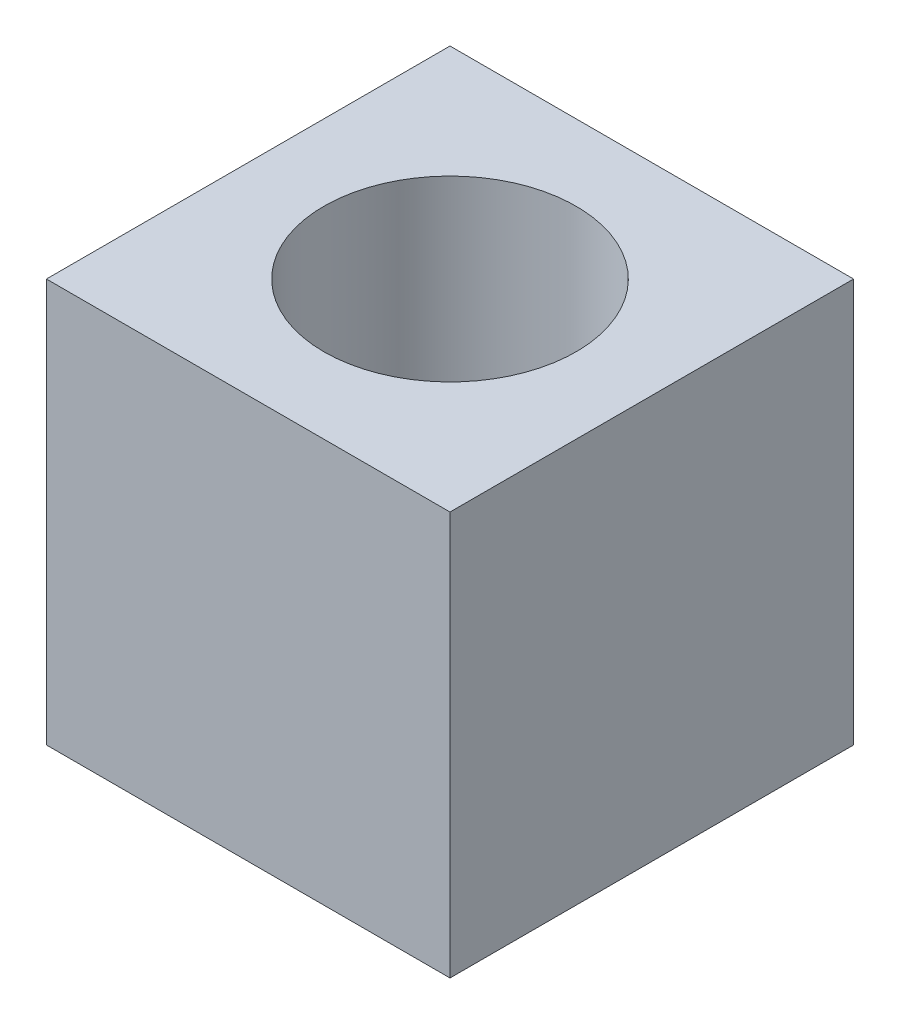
from build123d import *

# Parameters (mm, degrees)
SKETCH3_W          = 101.6
SKETCH3_H          = 101.6
EXTRUDE1_DEPTH     = 50.8
SKETCH4_R          = 31.75
CUT_EXTRUDE1_DEPTH = 125.434078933


with BuildPart() as part:
    # Sketch3 → Extrude1 (new, symmetric)
    with BuildSketch(Plane.XY):
        with Locations((0, 50.8)):
            Rectangle(SKETCH3_W, SKETCH3_H)
    extrude(amount=EXTRUDE1_DEPTH, both=True)

    # Sketch4 → Cut-Extrude1 (cut, through all)
    with BuildSketch(Plane(origin=(0, 101.6, 0), x_dir=(-1, 0, 0), z_dir=(0, 1, 0))):
        with Locations(Location((0, 0, 0), (0, 0, 90))):
            Circle(SKETCH4_R)
    extrude(amount=-CUT_EXTRUDE1_DEPTH, mode=Mode.SUBTRACT)


solid = part.part
